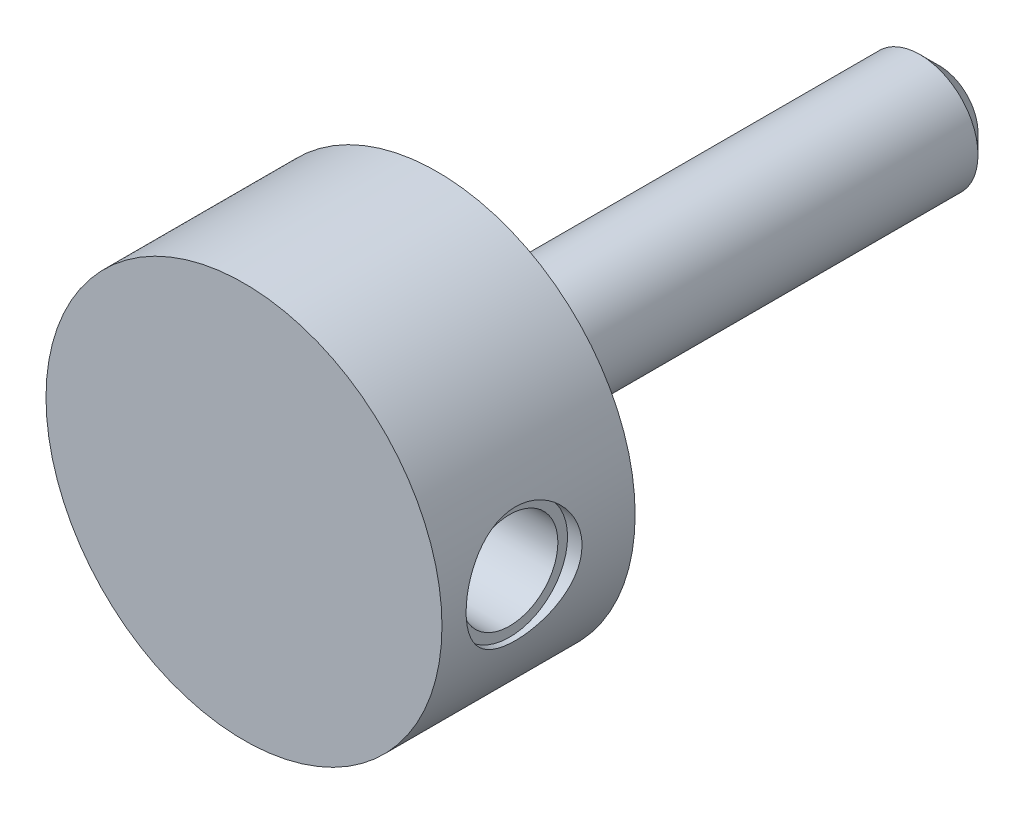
ISO-10303-21;
HEADER;
FILE_DESCRIPTION(('STEP AP214'),'2;1');
FILE_NAME('part.step','',(''),(''),'','','');
FILE_SCHEMA(('AUTOMOTIVE_DESIGN { 1 0 10303 214 1 1 1 1 }'));
ENDSEC;
DATA;
#1=APPLICATION_CONTEXT('core data for automotive mechanical design processes');
#2=APPLICATION_PROTOCOL_DEFINITION('international standard','automotive_design',2000,#1);
#3=PRODUCT_CONTEXT('',#1,'mechanical');
#4=PRODUCT('Part','Part','',(#3));
#5=PRODUCT_RELATED_PRODUCT_CATEGORY('part','',(#4));
#6=PRODUCT_DEFINITION_FORMATION('','',#4);
#7=PRODUCT_DEFINITION_CONTEXT('part definition',#1,'design');
#8=PRODUCT_DEFINITION('design','',#6,#7);
#9=PRODUCT_DEFINITION_SHAPE('','',#8);
#10=(LENGTH_UNIT() NAMED_UNIT(*) SI_UNIT(.MILLI.,.METRE.));
#11=(NAMED_UNIT(*) PLANE_ANGLE_UNIT() SI_UNIT($,.RADIAN.));
#12=(NAMED_UNIT(*) SI_UNIT($,.STERADIAN.) SOLID_ANGLE_UNIT());
#13=UNCERTAINTY_MEASURE_WITH_UNIT(LENGTH_MEASURE(1.E-05),#10,'distance_accuracy_value','');
#14=(GEOMETRIC_REPRESENTATION_CONTEXT(3) GLOBAL_UNCERTAINTY_ASSIGNED_CONTEXT((#13)) GLOBAL_UNIT_ASSIGNED_CONTEXT((#10,
#11,#12)) REPRESENTATION_CONTEXT('',''));
#15=CARTESIAN_POINT('',(0.,0.,0.));
#16=DIRECTION('',(0.,0.,1.));
#17=DIRECTION('',(1.,0.,0.));
#18=AXIS2_PLACEMENT_3D('',#15,#16,#17);
#19=CARTESIAN_POINT('',(0.,0.,0.));
#20=DIRECTION('',(0.,0.,1.));
#21=DIRECTION('',(1.,0.,0.));
#22=AXIS2_PLACEMENT_3D('',#19,#20,#21);
#23=PLANE('',#22);
#24=CARTESIAN_POINT('',(0.,0.,0.));
#25=DIRECTION('',(0.,0.,1.));
#26=DIRECTION('',(1.,0.,0.));
#27=AXIS2_PLACEMENT_3D('',#24,#25,#26);
#28=CIRCLE('',#27,9.5);
#29=CARTESIAN_POINT('',(9.5,0.,0.));
#30=VERTEX_POINT('',#29);
#31=EDGE_CURVE('E27',#30,#30,#28,.T.);
#32=ORIENTED_EDGE('',*,*,#31,.F.);
#33=EDGE_LOOP('',(#32));
#34=FACE_BOUND('',#33,.T.);
#35=CARTESIAN_POINT('',(0.,0.,0.));
#36=DIRECTION('',(0.,0.,1.));
#37=DIRECTION('',(1.,0.,0.));
#38=AXIS2_PLACEMENT_3D('',#35,#36,#37);
#39=CIRCLE('',#38,6.);
#40=CARTESIAN_POINT('',(6.,0.,0.));
#41=VERTEX_POINT('',#40);
#42=EDGE_CURVE('E23',#41,#41,#39,.F.);
#43=ORIENTED_EDGE('',*,*,#42,.F.);
#44=EDGE_LOOP('',(#43));
#45=FACE_BOUND('',#44,.T.);
#46=ADVANCED_FACE('F12',(#34,#45),#23,.F.);
#47=CARTESIAN_POINT('',(0.,0.,40.));
#48=DIRECTION('',(0.,0.,1.));
#49=DIRECTION('',(1.,0.,0.));
#50=AXIS2_PLACEMENT_3D('',#47,#48,#49);
#51=CYLINDRICAL_SURFACE('',#50,9.5);
#52=CARTESIAN_POINT('',(0.,0.,2.));
#53=DIRECTION('',(0.,0.,1.));
#54=DIRECTION('',(1.,0.,0.));
#55=AXIS2_PLACEMENT_3D('',#52,#53,#54);
#56=CIRCLE('',#55,9.5);
#57=CARTESIAN_POINT('',(9.5,0.,2.));
#58=VERTEX_POINT('',#57);
#59=EDGE_CURVE('E38',#58,#58,#56,.T.);
#60=ORIENTED_EDGE('',*,*,#59,.F.);
#61=EDGE_LOOP('',(#60));
#62=FACE_BOUND('',#61,.T.);
#63=ORIENTED_EDGE('',*,*,#31,.T.);
#64=EDGE_LOOP('',(#63));
#65=FACE_BOUND('',#64,.T.);
#66=ADVANCED_FACE('F65',(#62,#65),#51,.T.);
#67=CARTESIAN_POINT('',(20.5,0.,22.));
#68=DIRECTION('',(0.,0.,-1.));
#69=DIRECTION('',(-1.,0.,0.));
#70=AXIS2_PLACEMENT_3D('',#67,#68,#69);
#71=PLANE('',#70);
#72=CARTESIAN_POINT('',(0.,0.,22.));
#73=DIRECTION('',(0.,0.,1.));
#74=DIRECTION('',(1.,0.,0.));
#75=AXIS2_PLACEMENT_3D('',#72,#73,#74);
#76=CIRCLE('',#75,20.5);
#77=CARTESIAN_POINT('',(20.5,0.,22.));
#78=VERTEX_POINT('',#77);
#79=EDGE_CURVE('E82',#78,#78,#76,.T.);
#80=ORIENTED_EDGE('',*,*,#79,.T.);
#81=EDGE_LOOP('',(#80));
#82=FACE_BOUND('',#81,.T.);
#83=ADVANCED_FACE('F60',(#82),#71,.F.);
#84=CARTESIAN_POINT('',(0.,0.,40.));
#85=DIRECTION('',(0.,0.,1.));
#86=DIRECTION('',(1.,0.,0.));
#87=AXIS2_PLACEMENT_3D('',#84,#85,#86);
#88=CYLINDRICAL_SURFACE('',#87,20.5);
#89=CARTESIAN_POINT('',(20.5,0.,7.5));
#90=CARTESIAN_POINT('',(20.4999997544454,-0.164768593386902,7.50000038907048));
#91=CARTESIAN_POINT('',(20.4980087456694,-0.329544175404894,7.50679278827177));
#92=CARTESIAN_POINT('',(20.4900990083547,-0.65788822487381,7.5339021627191));
#93=CARTESIAN_POINT('',(20.4841800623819,-0.821456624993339,7.55421988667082));
#94=CARTESIAN_POINT('',(20.4685766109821,-1.1462122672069,7.60820100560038));
#95=CARTESIAN_POINT('',(20.4588916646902,-1.30739922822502,7.64186596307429));
#96=CARTESIAN_POINT('',(20.4360164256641,-1.62628314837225,7.72226244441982));
#97=CARTESIAN_POINT('',(20.4228249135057,-1.7839788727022,7.76899851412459));
#98=CARTESIAN_POINT('',(20.3933182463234,-2.09448185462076,7.87505403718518));
#99=CARTESIAN_POINT('',(20.3770082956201,-2.24729676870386,7.93435254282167));
#100=CARTESIAN_POINT('',(20.3416823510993,-2.54730770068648,8.06511256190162));
#101=CARTESIAN_POINT('',(20.3226662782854,-2.69450355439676,8.13657443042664));
#102=CARTESIAN_POINT('',(20.2824208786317,-2.98237032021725,8.2911456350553));
#103=CARTESIAN_POINT('',(20.2611910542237,-3.123039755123,8.37425759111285));
#104=CARTESIAN_POINT('',(20.2170775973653,-3.39691169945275,8.55150630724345));
#105=CARTESIAN_POINT('',(20.1941944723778,-3.53011647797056,8.6456396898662));
#106=CARTESIAN_POINT('',(20.146767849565,-3.79154794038,8.84682399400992));
#107=CARTESIAN_POINT('',(20.1221971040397,-3.91956600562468,8.95413966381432));
#108=CARTESIAN_POINT('',(20.0725990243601,-4.1661228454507,9.17897611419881));
#109=CARTESIAN_POINT('',(20.0475718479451,-4.2846648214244,9.29649342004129));
#110=CARTESIAN_POINT('',(19.9977175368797,-4.5116297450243,9.54108035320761));
#111=CARTESIAN_POINT('',(19.9728905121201,-4.62004743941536,9.66815487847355));
#112=CARTESIAN_POINT('',(19.9241410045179,-4.82595045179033,9.93095842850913));
#113=CARTESIAN_POINT('',(19.9002181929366,-4.92343976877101,10.0666842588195));
#114=CARTESIAN_POINT('',(19.8534354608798,-5.10885934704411,10.3490171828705));
#115=CARTESIAN_POINT('',(19.8306098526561,-5.19653638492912,10.4957964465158));
#116=CARTESIAN_POINT('',(19.7872868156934,-5.35913808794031,10.7965125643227));
#117=CARTESIAN_POINT('',(19.766788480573,-5.43406772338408,10.9504465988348));
#118=CARTESIAN_POINT('',(19.7287391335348,-5.57062666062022,11.2645036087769));
#119=CARTESIAN_POINT('',(19.7111887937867,-5.63225293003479,11.4246279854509));
#120=CARTESIAN_POINT('',(19.6796082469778,-5.74162541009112,11.7498143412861));
#121=CARTESIAN_POINT('',(19.6655765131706,-5.78937764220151,11.9148741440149));
#122=CARTESIAN_POINT('',(19.6418018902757,-5.86952471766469,12.2443484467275));
#123=CARTESIAN_POINT('',(19.6319555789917,-5.90229162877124,12.4086649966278));
#124=CARTESIAN_POINT('',(19.6163432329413,-5.95397424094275,12.7395899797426));
#125=CARTESIAN_POINT('',(19.6105755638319,-5.97289549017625,12.9061974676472));
#126=CARTESIAN_POINT('',(19.603301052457,-5.99672775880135,13.2405034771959));
#127=CARTESIAN_POINT('',(19.6017941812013,-6.00163887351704,13.4082019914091));
#128=CARTESIAN_POINT('',(19.6030905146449,-5.99740342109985,13.7434027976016));
#129=CARTESIAN_POINT('',(19.6058936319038,-5.98825713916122,13.9109050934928));
#130=CARTESIAN_POINT('',(19.6155486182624,-5.95655212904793,14.238688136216));
#131=CARTESIAN_POINT('',(19.6222578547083,-5.9344657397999,14.3990190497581));
#132=CARTESIAN_POINT('',(19.6394095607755,-5.87745500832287,14.7172343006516));
#133=CARTESIAN_POINT('',(19.649853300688,-5.84252629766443,14.8751177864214));
#134=CARTESIAN_POINT('',(19.6741615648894,-5.7601395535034,15.187257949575));
#135=CARTESIAN_POINT('',(19.688025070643,-5.71268525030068,15.3415156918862));
#136=CARTESIAN_POINT('',(19.7187796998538,-5.60560692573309,15.6454959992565));
#137=CARTESIAN_POINT('',(19.7356719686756,-5.5459782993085,15.7952168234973));
#138=CARTESIAN_POINT('',(19.7722410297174,-5.41416819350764,16.0910079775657));
#139=CARTESIAN_POINT('',(19.7919506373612,-5.34183608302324,16.2370072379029));
#140=CARTESIAN_POINT('',(19.8334359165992,-5.18568691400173,16.5224423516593));
#141=CARTESIAN_POINT('',(19.8552123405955,-5.10186566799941,16.6618757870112));
#142=CARTESIAN_POINT('',(19.9227548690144,-4.8340177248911,17.0689782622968));
#143=CARTESIAN_POINT('',(19.9707648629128,-4.63350124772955,17.3256854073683));
#144=CARTESIAN_POINT('',(20.0696162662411,-4.18511260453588,17.8126329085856));
#145=CARTESIAN_POINT('',(20.1204944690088,-3.93567819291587,18.0414205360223));
#146=CARTESIAN_POINT('',(20.2176813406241,-3.40132203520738,18.4542852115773));
#147=CARTESIAN_POINT('',(20.2639897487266,-3.11639826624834,18.63835970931));
#148=CARTESIAN_POINT('',(20.3472018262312,-2.51664006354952,18.9573414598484));
#149=CARTESIAN_POINT('',(20.3840462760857,-2.2016334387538,19.0919412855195));
#150=CARTESIAN_POINT('',(20.4437541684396,-1.55212614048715,19.3058343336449));
#151=CARTESIAN_POINT('',(20.4666213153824,-1.21763065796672,19.3851422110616));
#152=CARTESIAN_POINT('',(20.4952175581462,-0.550953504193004,19.4838192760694));
#153=CARTESIAN_POINT('',(20.5015074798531,-0.219085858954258,19.5051506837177));
#154=CARTESIAN_POINT('',(20.4978783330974,0.44350281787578,19.4927506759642));
#155=CARTESIAN_POINT('',(20.4879613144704,0.774223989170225,19.4590262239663));
#156=CARTESIAN_POINT('',(20.4533992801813,1.41781519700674,19.3390673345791));
#157=CARTESIAN_POINT('',(20.4290727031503,1.73091547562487,19.253967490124));
#158=CARTESIAN_POINT('',(20.3684901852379,2.33834273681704,19.0350155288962));
#159=CARTESIAN_POINT('',(20.3322328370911,2.63266749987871,18.901157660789));
#160=CARTESIAN_POINT('',(20.2505580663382,3.201467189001,18.585163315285));
#161=CARTESIAN_POINT('',(20.2049537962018,3.47535043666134,18.4020133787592));
#162=CARTESIAN_POINT('',(20.1098009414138,3.98926947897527,17.9937010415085));
#163=CARTESIAN_POINT('',(20.0602514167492,4.22929716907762,17.7685286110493));
#164=CARTESIAN_POINT('',(19.9860369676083,4.56311282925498,17.3996018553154));
#165=CARTESIAN_POINT('',(19.9608943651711,4.67160496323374,17.2689475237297));
#166=CARTESIAN_POINT('',(19.9116554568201,4.87720494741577,16.9988051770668));
#167=CARTESIAN_POINT('',(19.8875587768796,4.97431688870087,16.8593203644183));
#168=CARTESIAN_POINT('',(19.8411019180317,5.15650338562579,16.5723575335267));
#169=CARTESIAN_POINT('',(19.8187424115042,5.24157329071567,16.4248764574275));
#170=CARTESIAN_POINT('',(19.7764458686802,5.39896546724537,16.1230001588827));
#171=CARTESIAN_POINT('',(19.7565078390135,5.47129297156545,15.9686078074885));
#172=CARTESIAN_POINT('',(19.7197444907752,5.60234699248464,15.6546484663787));
#173=CARTESIAN_POINT('',(19.7029051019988,5.6611353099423,15.49510893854));
#174=CARTESIAN_POINT('',(19.6727610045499,5.76501533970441,15.1713718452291));
#175=CARTESIAN_POINT('',(19.6594548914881,5.81011249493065,15.0071761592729));
#176=CARTESIAN_POINT('',(19.6367999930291,5.88622676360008,14.675294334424));
#177=CARTESIAN_POINT('',(19.6274509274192,5.91724487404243,14.5076084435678));
#178=CARTESIAN_POINT('',(19.6130187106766,5.96490739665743,14.1700260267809));
#179=CARTESIAN_POINT('',(19.6079354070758,5.98155232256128,14.0001295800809));
#180=CARTESIAN_POINT('',(19.6023186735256,5.9999323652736,13.6662567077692));
#181=CARTESIAN_POINT('',(19.6016119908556,6.00223524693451,13.5023141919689));
#182=CARTESIAN_POINT('',(19.6043094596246,5.99341910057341,13.1747666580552));
#183=CARTESIAN_POINT('',(19.6077150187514,5.98229547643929,13.0111617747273));
#184=CARTESIAN_POINT('',(19.6185313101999,5.94672790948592,12.6856110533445));
#185=CARTESIAN_POINT('',(19.6259403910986,5.92228945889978,12.5236645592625));
#186=CARTESIAN_POINT('',(19.6445384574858,5.86030325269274,12.2024601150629));
#187=CARTESIAN_POINT('',(19.6557288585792,5.82275058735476,12.0432031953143));
#188=CARTESIAN_POINT('',(19.6814005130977,5.73537439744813,11.7303823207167));
#189=CARTESIAN_POINT('',(19.6958418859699,5.68569901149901,11.5767736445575));
#190=CARTESIAN_POINT('',(19.7276768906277,5.57423736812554,11.2742707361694));
#191=CARTESIAN_POINT('',(19.7450715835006,5.51244675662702,11.125378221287));
#192=CARTESIAN_POINT('',(19.782319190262,5.37724463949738,10.8333301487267));
#193=CARTESIAN_POINT('',(19.802171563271,5.30383568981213,10.6901733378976));
#194=CARTESIAN_POINT('',(19.8438063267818,5.14587421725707,10.4103722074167));
#195=CARTESIAN_POINT('',(19.8655894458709,5.061317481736,10.2737303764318));
#196=CARTESIAN_POINT('',(19.9112797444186,4.87853600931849,10.0032239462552));
#197=CARTESIAN_POINT('',(19.9352342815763,4.77994030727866,9.86961789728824));
#198=CARTESIAN_POINT('',(19.9839347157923,4.57206196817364,9.61107007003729));
#199=CARTESIAN_POINT('',(20.0086809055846,4.46277534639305,9.48613155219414));
#200=CARTESIAN_POINT('',(20.0582834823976,4.23425660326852,9.24575891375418));
#201=CARTESIAN_POINT('',(20.0831398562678,4.11502564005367,9.13032368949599));
#202=CARTESIAN_POINT('',(20.1323098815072,3.86730499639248,8.90963180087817));
#203=CARTESIAN_POINT('',(20.1566233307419,3.7388119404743,8.80437888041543));
#204=CARTESIAN_POINT('',(20.2046974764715,3.46977987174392,8.6020699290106));
#205=CARTESIAN_POINT('',(20.2284250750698,3.32900807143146,8.50531528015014));
#206=CARTESIAN_POINT('',(20.2739466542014,3.03949915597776,8.32403500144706));
#207=CARTESIAN_POINT('',(20.2957406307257,2.8907620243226,8.23950939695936));
#208=CARTESIAN_POINT('',(20.3367679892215,2.58639447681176,8.0833769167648));
#209=CARTESIAN_POINT('',(20.356002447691,2.43076699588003,8.01176460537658));
#210=CARTESIAN_POINT('',(20.3913677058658,2.11366097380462,7.88201306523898));
#211=CARTESIAN_POINT('',(20.4074988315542,1.95218304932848,7.82387242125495));
#212=CARTESIAN_POINT('',(20.4344672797,1.64423058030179,7.72771145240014));
#213=CARTESIAN_POINT('',(20.4457076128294,1.49828162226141,7.68811373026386));
#214=CARTESIAN_POINT('',(20.4651675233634,1.2036242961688,7.62002138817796));
#215=CARTESIAN_POINT('',(20.4733873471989,1.0549161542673,7.59152586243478));
#216=CARTESIAN_POINT('',(20.4866168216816,0.755624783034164,7.54584620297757));
#217=CARTESIAN_POINT('',(20.491626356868,0.605041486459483,7.52866247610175));
#218=CARTESIAN_POINT('',(20.49831762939,0.302973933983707,7.50574067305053));
#219=CARTESIAN_POINT('',(20.5000002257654,0.151489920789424,7.49999964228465));
#220=CARTESIAN_POINT('',(20.5,0.,7.5));
#221=B_SPLINE_CURVE_WITH_KNOTS('',3,(#89,#90,#91,#92,#93,#94,#95,#96,#97,#98,#99,#100,#101,#102,
#103,#104,#105,#106,#107,#108,#109,#110,#111,#112,#113,#114,#115,#116,#117,#118,#119,#120,#121,
#122,#123,#124,#125,#126,#127,#128,#129,#130,#131,#132,#133,#134,#135,#136,#137,#138,#139,#140,
#141,#142,#143,#144,#145,#146,#147,#148,#149,#150,#151,#152,#153,#154,#155,#156,#157,#158,#159,
#160,#161,#162,#163,#164,#165,#166,#167,#168,#169,#170,#171,#172,#173,#174,#175,#176,#177,#178,
#179,#180,#181,#182,#183,#184,#185,#186,#187,#188,#189,#190,#191,#192,#193,#194,#195,#196,#197,
#198,#199,#200,#201,#202,#203,#204,#205,#206,#207,#208,#209,#210,#211,#212,#213,#214,#215,#216,
#217,#218,#219,#220),.UNSPECIFIED.,.T.,.F.,(4,2,2,2,2,2,2,2,2,2,2,2,2,2,2,2,2,2,2,2,2,2,2,2,2,2,
2,2,2,2,2,2,2,2,2,2,2,2,2,2,2,2,2,2,2,2,2,2,2,2,2,2,2,2,2,2,2,2,2,2,2,2,2,2,2,4),(0.,
0.494166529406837,0.988360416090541,1.48261217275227,1.97703603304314,2.47064184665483,
2.96426207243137,3.45799348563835,3.95157399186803,4.45753270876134,4.96331976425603,
5.46936781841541,5.97523008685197,6.49206535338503,7.00869863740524,7.52544955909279,
8.04197586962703,8.54486934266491,9.04756118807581,9.55024961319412,10.0529278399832,
10.5383093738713,11.0238561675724,11.5092585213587,11.9948448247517,12.4866344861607,
12.9786038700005,13.9617709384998,14.9839152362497,16.006117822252,17.0345689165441,
18.062747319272,19.0556662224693,20.0484595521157,21.0200911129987,21.9918373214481,
22.9853318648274,23.97906383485,24.4935931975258,25.0079370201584,25.5224789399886,
26.0368090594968,26.5487427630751,27.0604726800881,27.5721663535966,28.0838417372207,
28.5751252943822,29.066577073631,29.5578262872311,30.0492596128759,30.5349645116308,
31.0208442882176,31.5066173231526,31.9925744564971,32.4953010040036,32.9982156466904,
33.5010718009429,34.0041121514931,34.5208552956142,35.0375995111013,35.5541256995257,
36.0705976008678,36.525077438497,36.9795201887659,37.4339792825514,37.8883210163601),.UNSPECIFIED.);
#222=CARTESIAN_POINT('',(20.5,0.,7.5));
#223=VERTEX_POINT('',#222);
#224=EDGE_CURVE('E30',#223,#223,#221,.T.);
#225=ORIENTED_EDGE('',*,*,#224,.T.);
#226=EDGE_LOOP('',(#225));
#227=FACE_BOUND('',#226,.T.);
#228=ORIENTED_EDGE('',*,*,#79,.F.);
#229=EDGE_LOOP('',(#228));
#230=FACE_BOUND('',#229,.T.);
#231=CARTESIAN_POINT('',(0.,0.,2.));
#232=DIRECTION('',(0.,0.,1.));
#233=DIRECTION('',(1.,0.,0.));
#234=AXIS2_PLACEMENT_3D('',#231,#232,#233);
#235=CIRCLE('',#234,20.5);
#236=CARTESIAN_POINT('',(20.5,0.,2.));
#237=VERTEX_POINT('',#236);
#238=EDGE_CURVE('E84',#237,#237,#235,.T.);
#239=ORIENTED_EDGE('',*,*,#238,.T.);
#240=EDGE_LOOP('',(#239));
#241=FACE_BOUND('',#240,.T.);
#242=ADVANCED_FACE('F41',(#227,#230,#241),#88,.T.);
#243=CARTESIAN_POINT('',(9.5,0.,2.));
#244=DIRECTION('',(0.,0.,1.));
#245=DIRECTION('',(1.,0.,0.));
#246=AXIS2_PLACEMENT_3D('',#243,#244,#245);
#247=PLANE('',#246);
#248=ORIENTED_EDGE('',*,*,#238,.F.);
#249=EDGE_LOOP('',(#248));
#250=FACE_BOUND('',#249,.T.);
#251=ORIENTED_EDGE('',*,*,#59,.T.);
#252=EDGE_LOOP('',(#251));
#253=FACE_BOUND('',#252,.T.);
#254=ADVANCED_FACE('F49',(#250,#253),#247,.F.);
#255=CARTESIAN_POINT('',(19.,0.,13.5));
#256=DIRECTION('',(1.,0.,0.));
#257=DIRECTION('',(0.,0.,-1.));
#258=AXIS2_PLACEMENT_3D('',#255,#256,#257);
#259=CYLINDRICAL_SURFACE('',#258,6.);
#260=CARTESIAN_POINT('',(19.,0.,13.5));
#261=DIRECTION('',(1.,0.,0.));
#262=DIRECTION('',(0.,0.,-1.));
#263=AXIS2_PLACEMENT_3D('',#260,#261,#262);
#264=CIRCLE('',#263,6.);
#265=CARTESIAN_POINT('',(19.,0.,7.5));
#266=VERTEX_POINT('',#265);
#267=EDGE_CURVE('E39',#266,#266,#264,.T.);
#268=ORIENTED_EDGE('',*,*,#267,.F.);
#269=EDGE_LOOP('',(#268));
#270=FACE_BOUND('',#269,.T.);
#271=ORIENTED_EDGE('',*,*,#224,.F.);
#272=EDGE_LOOP('',(#271));
#273=FACE_BOUND('',#272,.T.);
#274=ADVANCED_FACE('F47',(#270,#273),#259,.F.);
#275=CARTESIAN_POINT('',(19.,0.,13.5));
#276=DIRECTION('',(1.,0.,0.));
#277=DIRECTION('',(0.,0.,-1.));
#278=AXIS2_PLACEMENT_3D('',#275,#276,#277);
#279=PLANE('',#278);
#280=CARTESIAN_POINT('',(19.,0.,13.5));
#281=DIRECTION('',(1.,0.,0.));
#282=DIRECTION('',(0.,0.,-1.));
#283=AXIS2_PLACEMENT_3D('',#280,#281,#282);
#284=CIRCLE('',#283,5.);
#285=CARTESIAN_POINT('',(19.,0.,8.5));
#286=VERTEX_POINT('',#285);
#287=EDGE_CURVE('E96',#286,#286,#284,.T.);
#288=ORIENTED_EDGE('',*,*,#287,.F.);
#289=EDGE_LOOP('',(#288));
#290=FACE_BOUND('',#289,.T.);
#291=ORIENTED_EDGE('',*,*,#267,.T.);
#292=EDGE_LOOP('',(#291));
#293=FACE_BOUND('',#292,.T.);
#294=ADVANCED_FACE('F58',(#290,#293),#279,.T.);
#295=CARTESIAN_POINT('',(10.,0.,13.5));
#296=DIRECTION('',(1.,0.,0.));
#297=DIRECTION('',(0.,0.,-1.));
#298=AXIS2_PLACEMENT_3D('',#295,#296,#297);
#299=CYLINDRICAL_SURFACE('',#298,5.);
#300=CARTESIAN_POINT('',(10.,0.,13.5));
#301=DIRECTION('',(1.,0.,0.));
#302=DIRECTION('',(0.,0.,-1.));
#303=AXIS2_PLACEMENT_3D('',#300,#301,#302);
#304=CIRCLE('',#303,5.);
#305=CARTESIAN_POINT('',(10.,0.,8.5));
#306=VERTEX_POINT('',#305);
#307=EDGE_CURVE('E93',#306,#306,#304,.T.);
#308=ORIENTED_EDGE('',*,*,#307,.F.);
#309=EDGE_LOOP('',(#308));
#310=FACE_BOUND('',#309,.T.);
#311=ORIENTED_EDGE('',*,*,#287,.T.);
#312=EDGE_LOOP('',(#311));
#313=FACE_BOUND('',#312,.T.);
#314=ADVANCED_FACE('F100',(#310,#313),#299,.F.);
#315=CARTESIAN_POINT('',(10.,0.,13.5));
#316=DIRECTION('',(1.,0.,0.));
#317=DIRECTION('',(0.,0.,-1.));
#318=AXIS2_PLACEMENT_3D('',#315,#316,#317);
#319=PLANE('',#318);
#320=ORIENTED_EDGE('',*,*,#307,.T.);
#321=EDGE_LOOP('',(#320));
#322=FACE_BOUND('',#321,.T.);
#323=ADVANCED_FACE('F112',(#322),#319,.T.);
#324=CARTESIAN_POINT('',(0.,0.,-50.));
#325=DIRECTION('',(0.,0.,1.));
#326=DIRECTION('',(1.,0.,0.));
#327=AXIS2_PLACEMENT_3D('',#324,#325,#326);
#328=CYLINDRICAL_SURFACE('',#327,6.);
#329=CARTESIAN_POINT('',(0.,0.,-48.));
#330=DIRECTION('',(0.,0.,-1.));
#331=DIRECTION('',(-1.,0.,0.));
#332=AXIS2_PLACEMENT_3D('',#329,#330,#331);
#333=CIRCLE('',#332,6.);
#334=CARTESIAN_POINT('',(-6.,0.,-48.));
#335=VERTEX_POINT('',#334);
#336=EDGE_CURVE('E8',#335,#335,#333,.F.);
#337=ORIENTED_EDGE('',*,*,#336,.T.);
#338=EDGE_LOOP('',(#337));
#339=FACE_BOUND('',#338,.T.);
#340=ORIENTED_EDGE('',*,*,#42,.T.);
#341=EDGE_LOOP('',(#340));
#342=FACE_BOUND('',#341,.T.);
#343=ADVANCED_FACE('F118',(#339,#342),#328,.T.);
#344=CARTESIAN_POINT('',(0.,0.,-50.));
#345=DIRECTION('',(0.,0.,-1.));
#346=DIRECTION('',(-1.,0.,0.));
#347=AXIS2_PLACEMENT_3D('',#344,#345,#346);
#348=PLANE('',#347);
#349=CARTESIAN_POINT('',(0.,0.,-50.));
#350=DIRECTION('',(0.,0.,-1.));
#351=DIRECTION('',(-1.,0.,0.));
#352=AXIS2_PLACEMENT_3D('',#349,#350,#351);
#353=CIRCLE('',#352,4.);
#354=CARTESIAN_POINT('',(-4.,0.,-50.));
#355=VERTEX_POINT('',#354);
#356=EDGE_CURVE('E19',#355,#355,#353,.T.);
#357=ORIENTED_EDGE('',*,*,#356,.T.);
#358=EDGE_LOOP('',(#357));
#359=FACE_BOUND('',#358,.T.);
#360=ADVANCED_FACE('F122',(#359),#348,.T.);
#361=CARTESIAN_POINT('',(0.,0.,-50.));
#362=DIRECTION('',(0.,0.,1.));
#363=DIRECTION('',(1.,0.,0.));
#364=AXIS2_PLACEMENT_3D('',#361,#362,#363);
#365=CONICAL_SURFACE('',#364,4.,0.785398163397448);
#366=ORIENTED_EDGE('',*,*,#336,.F.);
#367=EDGE_LOOP('',(#366));
#368=FACE_BOUND('',#367,.T.);
#369=ORIENTED_EDGE('',*,*,#356,.F.);
#370=EDGE_LOOP('',(#369));
#371=FACE_BOUND('',#370,.T.);
#372=ADVANCED_FACE('F14',(#368,#371),#365,.T.);
#373=CLOSED_SHELL('',(#46,#66,#83,#242,#254,#274,#294,#314,#323,#343,#360,#372));
#374=MANIFOLD_SOLID_BREP('B1',#373);
#375=ADVANCED_BREP_SHAPE_REPRESENTATION('',(#18,#374),#14);
#376=SHAPE_DEFINITION_REPRESENTATION(#9,#375);
ENDSEC;
END-ISO-10303-21;
